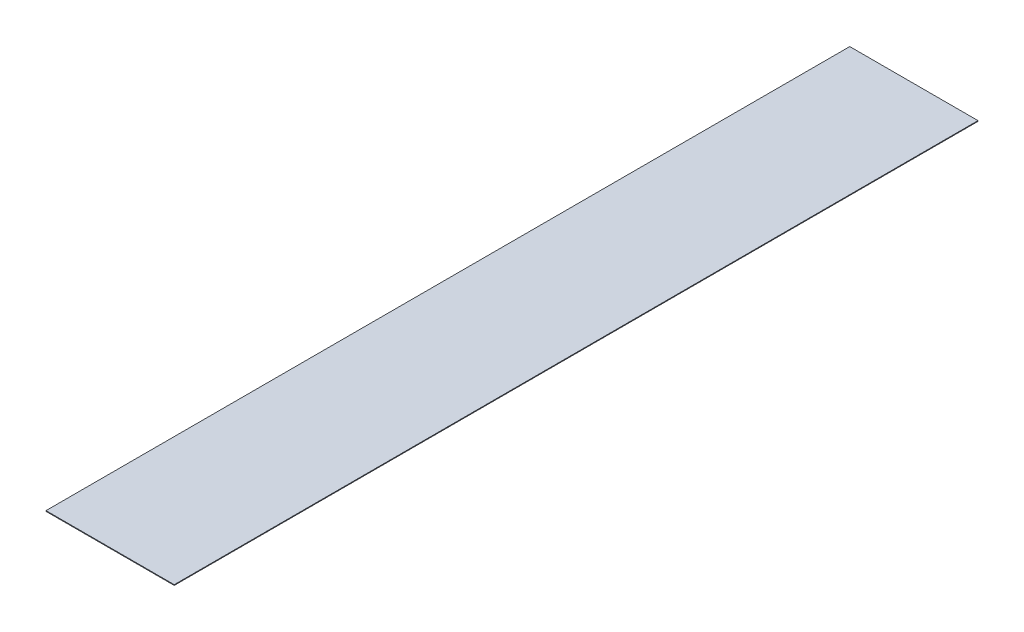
ISO-10303-21;
HEADER;
FILE_DESCRIPTION(('STEP AP214'),'2;1');
FILE_NAME('part.step','',(''),(''),'','','');
FILE_SCHEMA(('AUTOMOTIVE_DESIGN { 1 0 10303 214 1 1 1 1 }'));
ENDSEC;
DATA;
#1=APPLICATION_CONTEXT('core data for automotive mechanical design processes');
#2=APPLICATION_PROTOCOL_DEFINITION('international standard','automotive_design',2000,#1);
#3=PRODUCT_CONTEXT('',#1,'mechanical');
#4=PRODUCT('Part','Part','',(#3));
#5=PRODUCT_RELATED_PRODUCT_CATEGORY('part','',(#4));
#6=PRODUCT_DEFINITION_FORMATION('','',#4);
#7=PRODUCT_DEFINITION_CONTEXT('part definition',#1,'design');
#8=PRODUCT_DEFINITION('design','',#6,#7);
#9=PRODUCT_DEFINITION_SHAPE('','',#8);
#10=(LENGTH_UNIT() NAMED_UNIT(*) SI_UNIT(.MILLI.,.METRE.));
#11=(NAMED_UNIT(*) PLANE_ANGLE_UNIT() SI_UNIT($,.RADIAN.));
#12=(NAMED_UNIT(*) SI_UNIT($,.STERADIAN.) SOLID_ANGLE_UNIT());
#13=UNCERTAINTY_MEASURE_WITH_UNIT(LENGTH_MEASURE(1.E-05),#10,'distance_accuracy_value','');
#14=(GEOMETRIC_REPRESENTATION_CONTEXT(3) GLOBAL_UNCERTAINTY_ASSIGNED_CONTEXT((#13)) GLOBAL_UNIT_ASSIGNED_CONTEXT((#10,
#11,#12)) REPRESENTATION_CONTEXT('',''));
#15=CARTESIAN_POINT('',(0.,0.,0.));
#16=DIRECTION('',(0.,0.,1.));
#17=DIRECTION('',(1.,0.,0.));
#18=AXIS2_PLACEMENT_3D('',#15,#16,#17);
#19=CARTESIAN_POINT('',(0.,0.254,0.));
#20=DIRECTION('',(-1.,0.,0.));
#21=DIRECTION('',(0.,0.,1.));
#22=AXIS2_PLACEMENT_3D('',#19,#20,#21);
#23=PLANE('',#22);
#24=DIRECTION('',(0.,0.,-1.));
#25=VECTOR('',#24,1.);
#26=CARTESIAN_POINT('',(0.,0.,0.));
#27=LINE('',#26,#25);
#28=CARTESIAN_POINT('',(0.,0.,298.45));
#29=VERTEX_POINT('',#28);
#30=CARTESIAN_POINT('',(0.,0.,0.));
#31=VERTEX_POINT('',#30);
#32=EDGE_CURVE('E96',#29,#31,#27,.T.);
#33=ORIENTED_EDGE('',*,*,#32,.T.);
#34=DIRECTION('',(0.,-1.,0.));
#35=VECTOR('',#34,1.);
#36=CARTESIAN_POINT('',(0.,0.254,0.));
#37=LINE('',#36,#35);
#38=CARTESIAN_POINT('',(0.,0.254,0.));
#39=VERTEX_POINT('',#38);
#40=EDGE_CURVE('E11',#39,#31,#37,.T.);
#41=ORIENTED_EDGE('',*,*,#40,.F.);
#42=DIRECTION('',(0.,0.,-1.));
#43=VECTOR('',#42,1.);
#44=CARTESIAN_POINT('',(0.,0.254,0.));
#45=LINE('',#44,#43);
#46=CARTESIAN_POINT('',(0.,0.254,298.45));
#47=VERTEX_POINT('',#46);
#48=EDGE_CURVE('E84',#47,#39,#45,.T.);
#49=ORIENTED_EDGE('',*,*,#48,.F.);
#50=DIRECTION('',(0.,-1.,0.));
#51=VECTOR('',#50,1.);
#52=CARTESIAN_POINT('',(0.,0.254,298.45));
#53=LINE('',#52,#51);
#54=EDGE_CURVE('E92',#47,#29,#53,.T.);
#55=ORIENTED_EDGE('',*,*,#54,.T.);
#56=EDGE_LOOP('',(#33,#41,#49,#55));
#57=FACE_BOUND('',#56,.T.);
#58=ADVANCED_FACE('F33',(#57),#23,.F.);
#59=CARTESIAN_POINT('',(-47.625,0.254,0.));
#60=DIRECTION('',(0.,0.,1.));
#61=DIRECTION('',(1.,0.,0.));
#62=AXIS2_PLACEMENT_3D('',#59,#60,#61);
#63=PLANE('',#62);
#64=DIRECTION('',(-1.,0.,0.));
#65=VECTOR('',#64,1.);
#66=CARTESIAN_POINT('',(-47.625,0.,0.));
#67=LINE('',#66,#65);
#68=CARTESIAN_POINT('',(-47.625,0.,0.));
#69=VERTEX_POINT('',#68);
#70=EDGE_CURVE('E88',#31,#69,#67,.T.);
#71=ORIENTED_EDGE('',*,*,#70,.T.);
#72=DIRECTION('',(0.,-1.,0.));
#73=VECTOR('',#72,1.);
#74=CARTESIAN_POINT('',(-47.625,0.254,0.));
#75=LINE('',#74,#73);
#76=CARTESIAN_POINT('',(-47.625,0.254,0.));
#77=VERTEX_POINT('',#76);
#78=EDGE_CURVE('E41',#77,#69,#75,.T.);
#79=ORIENTED_EDGE('',*,*,#78,.F.);
#80=DIRECTION('',(-1.,0.,0.));
#81=VECTOR('',#80,1.);
#82=CARTESIAN_POINT('',(-47.625,0.254,0.));
#83=LINE('',#82,#81);
#84=EDGE_CURVE('E79',#39,#77,#83,.T.);
#85=ORIENTED_EDGE('',*,*,#84,.F.);
#86=ORIENTED_EDGE('',*,*,#40,.T.);
#87=EDGE_LOOP('',(#71,#79,#85,#86));
#88=FACE_BOUND('',#87,.T.);
#89=ADVANCED_FACE('F87',(#88),#63,.F.);
#90=CARTESIAN_POINT('',(-47.625,0.254,0.));
#91=DIRECTION('',(1.,0.,0.));
#92=DIRECTION('',(0.,0.,-1.));
#93=AXIS2_PLACEMENT_3D('',#90,#91,#92);
#94=PLANE('',#93);
#95=DIRECTION('',(0.,0.,1.));
#96=VECTOR('',#95,1.);
#97=CARTESIAN_POINT('',(-47.625,0.,0.));
#98=LINE('',#97,#96);
#99=CARTESIAN_POINT('',(-47.625,0.,298.45));
#100=VERTEX_POINT('',#99);
#101=EDGE_CURVE('E66',#69,#100,#98,.T.);
#102=ORIENTED_EDGE('',*,*,#101,.T.);
#103=DIRECTION('',(0.,-1.,0.));
#104=VECTOR('',#103,1.);
#105=CARTESIAN_POINT('',(-47.625,0.254,298.45));
#106=LINE('',#105,#104);
#107=CARTESIAN_POINT('',(-47.625,0.254,298.45));
#108=VERTEX_POINT('',#107);
#109=EDGE_CURVE('E89',#108,#100,#106,.T.);
#110=ORIENTED_EDGE('',*,*,#109,.F.);
#111=DIRECTION('',(0.,0.,1.));
#112=VECTOR('',#111,1.);
#113=CARTESIAN_POINT('',(-47.625,0.254,0.));
#114=LINE('',#113,#112);
#115=EDGE_CURVE('E82',#77,#108,#114,.T.);
#116=ORIENTED_EDGE('',*,*,#115,.F.);
#117=ORIENTED_EDGE('',*,*,#78,.T.);
#118=EDGE_LOOP('',(#102,#110,#116,#117));
#119=FACE_BOUND('',#118,.T.);
#120=ADVANCED_FACE('F90',(#119),#94,.F.);
#121=CARTESIAN_POINT('',(0.,0.254,298.45));
#122=DIRECTION('',(0.,0.,-1.));
#123=DIRECTION('',(-1.,0.,0.));
#124=AXIS2_PLACEMENT_3D('',#121,#122,#123);
#125=PLANE('',#124);
#126=DIRECTION('',(1.,0.,0.));
#127=VECTOR('',#126,1.);
#128=CARTESIAN_POINT('',(0.,0.,298.45));
#129=LINE('',#128,#127);
#130=EDGE_CURVE('E72',#100,#29,#129,.T.);
#131=ORIENTED_EDGE('',*,*,#130,.T.);
#132=ORIENTED_EDGE('',*,*,#54,.F.);
#133=DIRECTION('',(1.,0.,0.));
#134=VECTOR('',#133,1.);
#135=CARTESIAN_POINT('',(0.,0.254,298.45));
#136=LINE('',#135,#134);
#137=EDGE_CURVE('E49',#108,#47,#136,.T.);
#138=ORIENTED_EDGE('',*,*,#137,.F.);
#139=ORIENTED_EDGE('',*,*,#109,.T.);
#140=EDGE_LOOP('',(#131,#132,#138,#139));
#141=FACE_BOUND('',#140,.T.);
#142=ADVANCED_FACE('F103',(#141),#125,.F.);
#143=CARTESIAN_POINT('',(0.,0.254,298.45));
#144=DIRECTION('',(0.,-1.,0.));
#145=DIRECTION('',(0.,0.,-1.));
#146=AXIS2_PLACEMENT_3D('',#143,#144,#145);
#147=PLANE('',#146);
#148=ORIENTED_EDGE('',*,*,#48,.T.);
#149=ORIENTED_EDGE('',*,*,#84,.T.);
#150=ORIENTED_EDGE('',*,*,#115,.T.);
#151=ORIENTED_EDGE('',*,*,#137,.T.);
#152=EDGE_LOOP('',(#148,#149,#150,#151));
#153=FACE_BOUND('',#152,.T.);
#154=ADVANCED_FACE('F80',(#153),#147,.F.);
#155=CARTESIAN_POINT('',(0.,0.,298.45));
#156=DIRECTION('',(0.,-1.,0.));
#157=DIRECTION('',(0.,0.,-1.));
#158=AXIS2_PLACEMENT_3D('',#155,#156,#157);
#159=PLANE('',#158);
#160=ORIENTED_EDGE('',*,*,#32,.F.);
#161=ORIENTED_EDGE('',*,*,#130,.F.);
#162=ORIENTED_EDGE('',*,*,#101,.F.);
#163=ORIENTED_EDGE('',*,*,#70,.F.);
#164=EDGE_LOOP('',(#160,#161,#162,#163));
#165=FACE_BOUND('',#164,.T.);
#166=ADVANCED_FACE('F106',(#165),#159,.T.);
#167=CLOSED_SHELL('',(#58,#89,#120,#142,#154,#166));
#168=MANIFOLD_SOLID_BREP('B2',#167);
#169=ADVANCED_BREP_SHAPE_REPRESENTATION('',(#18,#168),#14);
#170=SHAPE_DEFINITION_REPRESENTATION(#9,#169);
ENDSEC;
END-ISO-10303-21;
